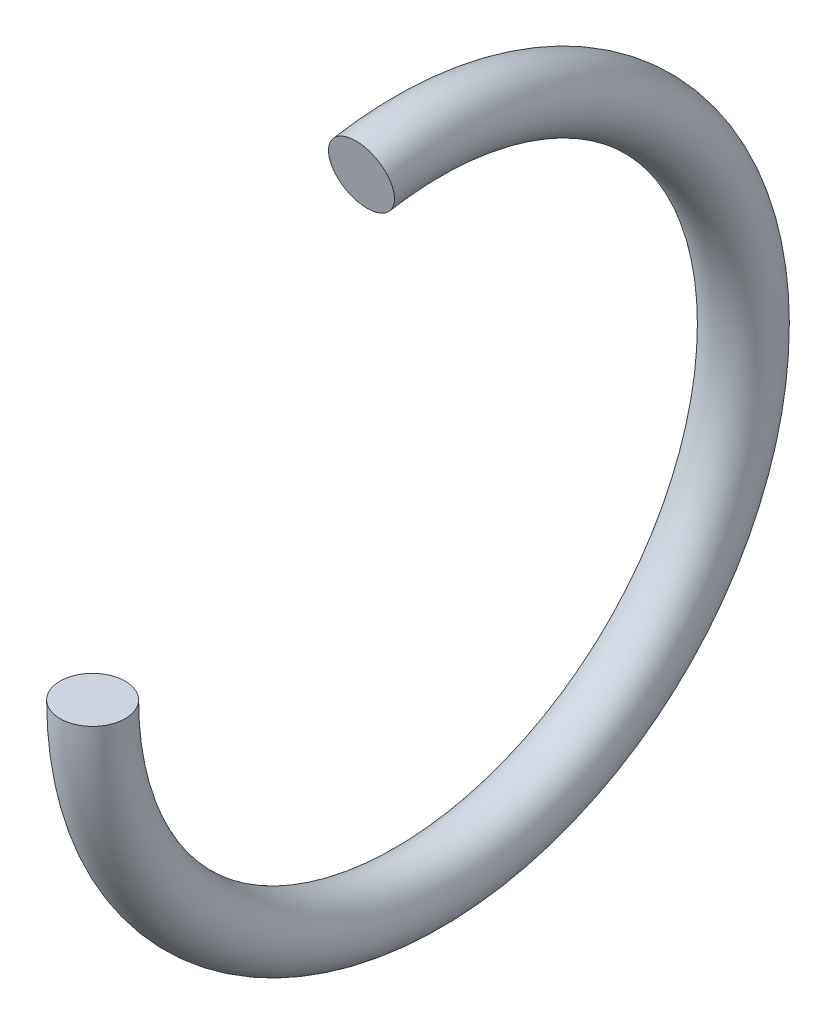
ISO-10303-21;
HEADER;
FILE_DESCRIPTION(('STEP AP214'),'2;1');
FILE_NAME('part.step','',(''),(''),'','','');
FILE_SCHEMA(('AUTOMOTIVE_DESIGN { 1 0 10303 214 1 1 1 1 }'));
ENDSEC;
DATA;
#1=APPLICATION_CONTEXT('core data for automotive mechanical design processes');
#2=APPLICATION_PROTOCOL_DEFINITION('international standard','automotive_design',2000,#1);
#3=PRODUCT_CONTEXT('',#1,'mechanical');
#4=PRODUCT('Part','Part','',(#3));
#5=PRODUCT_RELATED_PRODUCT_CATEGORY('part','',(#4));
#6=PRODUCT_DEFINITION_FORMATION('','',#4);
#7=PRODUCT_DEFINITION_CONTEXT('part definition',#1,'design');
#8=PRODUCT_DEFINITION('design','',#6,#7);
#9=PRODUCT_DEFINITION_SHAPE('','',#8);
#10=(LENGTH_UNIT() NAMED_UNIT(*) SI_UNIT(.MILLI.,.METRE.));
#11=(NAMED_UNIT(*) PLANE_ANGLE_UNIT() SI_UNIT($,.RADIAN.));
#12=(NAMED_UNIT(*) SI_UNIT($,.STERADIAN.) SOLID_ANGLE_UNIT());
#13=UNCERTAINTY_MEASURE_WITH_UNIT(LENGTH_MEASURE(1.E-05),#10,'distance_accuracy_value','');
#14=(GEOMETRIC_REPRESENTATION_CONTEXT(3) GLOBAL_UNCERTAINTY_ASSIGNED_CONTEXT((#13)) GLOBAL_UNIT_ASSIGNED_CONTEXT((#10,
#11,#12)) REPRESENTATION_CONTEXT('',''));
#15=CARTESIAN_POINT('',(0.,0.,0.));
#16=DIRECTION('',(0.,0.,1.));
#17=DIRECTION('',(1.,0.,0.));
#18=AXIS2_PLACEMENT_3D('',#15,#16,#17);
#19=CARTESIAN_POINT('',(41.15,0.,0.));
#20=DIRECTION('',(-1.,0.,0.));
#21=DIRECTION('',(0.,0.,1.));
#22=AXIS2_PLACEMENT_3D('',#19,#20,#21);
#23=TOROIDAL_SURFACE('',#22,2.5,0.25);
#24=CARTESIAN_POINT('',(41.15,2.46201938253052,0.434120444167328));
#25=DIRECTION('',(0.,-0.173648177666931,0.984807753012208));
#26=DIRECTION('',(1.,0.,0.));
#27=AXIS2_PLACEMENT_3D('',#24,#25,#26);
#28=CIRCLE('',#27,0.25);
#29=CARTESIAN_POINT('',(41.15,2.70822132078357,0.47753248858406));
#30=VERTEX_POINT('',#29);
#31=EDGE_CURVE('E10',#30,#30,#28,.T.);
#32=CARTESIAN_POINT('',(41.15,0.,2.5));
#33=DIRECTION('',(0.,-1.,0.));
#34=DIRECTION('',(1.,0.,0.));
#35=AXIS2_PLACEMENT_3D('',#32,#33,#34);
#36=CIRCLE('',#35,0.25);
#37=CARTESIAN_POINT('',(41.15,0.,2.75));
#38=VERTEX_POINT('',#37);
#39=EDGE_CURVE('E28',#38,#38,#36,.T.);
#40=CARTESIAN_POINT('',(41.15,0.,0.));
#41=DIRECTION('',(-1.,0.,0.));
#42=DIRECTION('',(0.,0.,1.));
#43=AXIS2_PLACEMENT_3D('',#40,#41,#42);
#44=CIRCLE('',#43,2.75);
#45=EDGE_CURVE('',#30,#38,#44,.T.);
#46=ORIENTED_EDGE('',*,*,#31,.F.);
#47=ORIENTED_EDGE('',*,*,#39,.T.);
#48=ORIENTED_EDGE('',*,*,#45,.T.);
#49=ORIENTED_EDGE('',*,*,#45,.F.);
#50=EDGE_LOOP('',(#46,#48,#47,#49));
#51=FACE_BOUND('',#50,.T.);
#52=ADVANCED_FACE('F22',(#51),#23,.T.);
#53=CARTESIAN_POINT('',(41.15,2.46201938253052,0.434120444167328));
#54=DIRECTION('',(0.,-0.173648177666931,0.984807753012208));
#55=DIRECTION('',(1.,0.,0.));
#56=AXIS2_PLACEMENT_3D('',#53,#54,#55);
#57=PLANE('',#56);
#58=ORIENTED_EDGE('',*,*,#31,.T.);
#59=EDGE_LOOP('',(#58));
#60=FACE_BOUND('',#59,.T.);
#61=ADVANCED_FACE('F37',(#60),#57,.T.);
#62=CARTESIAN_POINT('',(41.15,0.,2.5));
#63=DIRECTION('',(0.,-1.,0.));
#64=DIRECTION('',(1.,0.,0.));
#65=AXIS2_PLACEMENT_3D('',#62,#63,#64);
#66=PLANE('',#65);
#67=ORIENTED_EDGE('',*,*,#39,.F.);
#68=EDGE_LOOP('',(#67));
#69=FACE_BOUND('',#68,.T.);
#70=ADVANCED_FACE('F35',(#69),#66,.F.);
#71=CLOSED_SHELL('',(#52,#61,#70));
#72=MANIFOLD_SOLID_BREP('B2',#71);
#73=ADVANCED_BREP_SHAPE_REPRESENTATION('',(#18,#72),#14);
#74=SHAPE_DEFINITION_REPRESENTATION(#9,#73);
ENDSEC;
END-ISO-10303-21;
